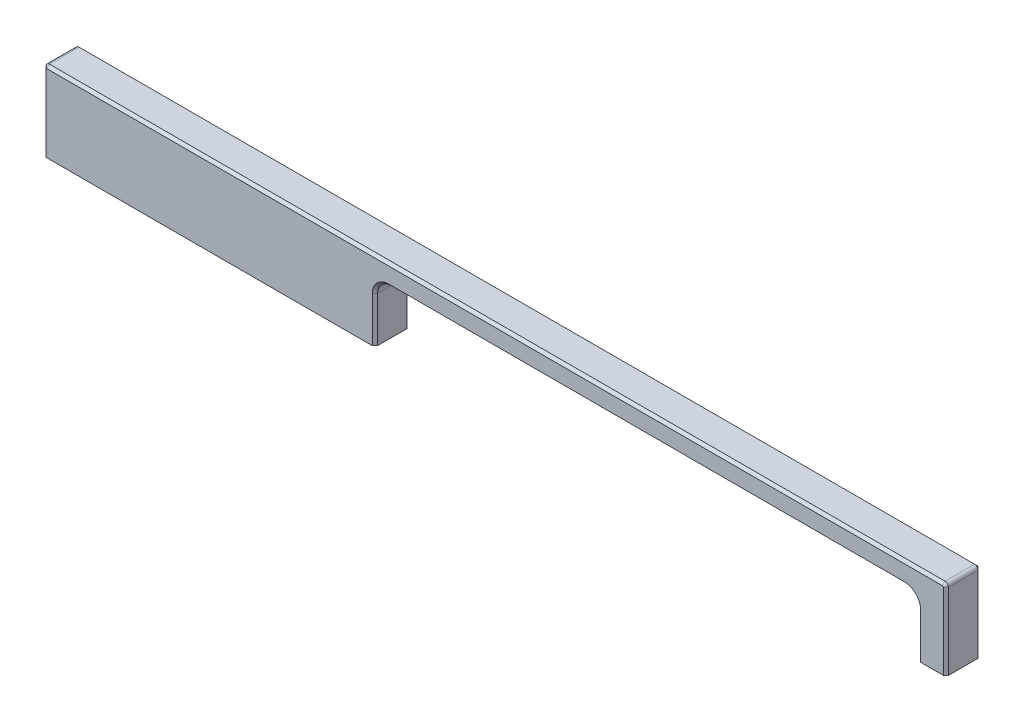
ISO-10303-21;
HEADER;
FILE_DESCRIPTION(('STEP AP214'),'2;1');
FILE_NAME('part.step','',(''),(''),'','','');
FILE_SCHEMA(('AUTOMOTIVE_DESIGN { 1 0 10303 214 1 1 1 1 }'));
ENDSEC;
DATA;
#1=APPLICATION_CONTEXT('core data for automotive mechanical design processes');
#2=APPLICATION_PROTOCOL_DEFINITION('international standard','automotive_design',2000,#1);
#3=PRODUCT_CONTEXT('',#1,'mechanical');
#4=PRODUCT('Part','Part','',(#3));
#5=PRODUCT_RELATED_PRODUCT_CATEGORY('part','',(#4));
#6=PRODUCT_DEFINITION_FORMATION('','',#4);
#7=PRODUCT_DEFINITION_CONTEXT('part definition',#1,'design');
#8=PRODUCT_DEFINITION('design','',#6,#7);
#9=PRODUCT_DEFINITION_SHAPE('','',#8);
#10=(LENGTH_UNIT() NAMED_UNIT(*) SI_UNIT(.MILLI.,.METRE.));
#11=(NAMED_UNIT(*) PLANE_ANGLE_UNIT() SI_UNIT($,.RADIAN.));
#12=(NAMED_UNIT(*) SI_UNIT($,.STERADIAN.) SOLID_ANGLE_UNIT());
#13=UNCERTAINTY_MEASURE_WITH_UNIT(LENGTH_MEASURE(1.E-05),#10,'distance_accuracy_value','');
#14=(GEOMETRIC_REPRESENTATION_CONTEXT(3) GLOBAL_UNCERTAINTY_ASSIGNED_CONTEXT((#13)) GLOBAL_UNIT_ASSIGNED_CONTEXT((#10,
#11,#12)) REPRESENTATION_CONTEXT('',''));
#15=CARTESIAN_POINT('',(0.,0.,0.));
#16=DIRECTION('',(0.,0.,1.));
#17=DIRECTION('',(1.,0.,0.));
#18=AXIS2_PLACEMENT_3D('',#15,#16,#17);
#19=CARTESIAN_POINT('',(130.,23.,5.));
#20=DIRECTION('',(-1.,0.,0.));
#21=DIRECTION('',(0.,0.,1.));
#22=AXIS2_PLACEMENT_3D('',#19,#20,#21);
#23=PLANE('',#22);
#24=DIRECTION('',(0.,0.,-1.));
#25=VECTOR('',#24,1.);
#26=CARTESIAN_POINT('',(130.,0.,5.));
#27=LINE('',#26,#25);
#28=CARTESIAN_POINT('',(130.,0.,4.25));
#29=VERTEX_POINT('',#28);
#30=CARTESIAN_POINT('',(130.,0.,-4.24999999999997));
#31=VERTEX_POINT('',#30);
#32=EDGE_CURVE('E248',#29,#31,#27,.T.);
#33=ORIENTED_EDGE('',*,*,#32,.T.);
#34=DIRECTION('',(0.,1.,0.));
#35=VECTOR('',#34,1.);
#36=CARTESIAN_POINT('',(130.,22.,-4.24999999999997));
#37=LINE('',#36,#35);
#38=CARTESIAN_POINT('',(130.,22.,-4.24999999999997));
#39=VERTEX_POINT('',#38);
#40=EDGE_CURVE('E390',#31,#39,#37,.T.);
#41=ORIENTED_EDGE('',*,*,#40,.T.);
#42=DIRECTION('',(0.,0.,-1.));
#43=VECTOR('',#42,1.);
#44=CARTESIAN_POINT('',(130.,22.,5.));
#45=LINE('',#44,#43);
#46=CARTESIAN_POINT('',(130.,22.,4.25));
#47=VERTEX_POINT('',#46);
#48=EDGE_CURVE('E294',#39,#47,#45,.F.);
#49=ORIENTED_EDGE('',*,*,#48,.T.);
#50=DIRECTION('',(0.,-1.,0.));
#51=VECTOR('',#50,1.);
#52=CARTESIAN_POINT('',(130.,23.,4.25));
#53=LINE('',#52,#51);
#54=EDGE_CURVE('E387',#47,#29,#53,.T.);
#55=ORIENTED_EDGE('',*,*,#54,.T.);
#56=EDGE_LOOP('',(#33,#41,#49,#55));
#57=FACE_BOUND('',#56,.T.);
#58=ADVANCED_FACE('F45',(#57),#23,.F.);
#59=CARTESIAN_POINT('',(-130.,23.,5.));
#60=DIRECTION('',(0.,-1.,0.));
#61=DIRECTION('',(0.,0.,-1.));
#62=AXIS2_PLACEMENT_3D('',#59,#60,#61);
#63=PLANE('',#62);
#64=DIRECTION('',(0.,0.,-1.));
#65=VECTOR('',#64,1.);
#66=CARTESIAN_POINT('',(129.,23.,5.));
#67=LINE('',#66,#65);
#68=CARTESIAN_POINT('',(129.,23.,4.25));
#69=VERTEX_POINT('',#68);
#70=CARTESIAN_POINT('',(129.,23.,-4.24999999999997));
#71=VERTEX_POINT('',#70);
#72=EDGE_CURVE('E290',#69,#71,#67,.T.);
#73=ORIENTED_EDGE('',*,*,#72,.T.);
#74=DIRECTION('',(-1.,0.,0.));
#75=VECTOR('',#74,1.);
#76=CARTESIAN_POINT('',(-129.,23.,-4.24999999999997));
#77=LINE('',#76,#75);
#78=CARTESIAN_POINT('',(-129.,23.,-4.24999999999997));
#79=VERTEX_POINT('',#78);
#80=EDGE_CURVE('E403',#71,#79,#77,.T.);
#81=ORIENTED_EDGE('',*,*,#80,.T.);
#82=DIRECTION('',(0.,0.,-1.));
#83=VECTOR('',#82,1.);
#84=CARTESIAN_POINT('',(-129.,23.,5.));
#85=LINE('',#84,#83);
#86=CARTESIAN_POINT('',(-129.,23.,4.25));
#87=VERTEX_POINT('',#86);
#88=EDGE_CURVE('E286',#79,#87,#85,.F.);
#89=ORIENTED_EDGE('',*,*,#88,.T.);
#90=DIRECTION('',(1.,0.,0.));
#91=VECTOR('',#90,1.);
#92=CARTESIAN_POINT('',(-130.,23.,4.25));
#93=LINE('',#92,#91);
#94=EDGE_CURVE('E400',#87,#69,#93,.T.);
#95=ORIENTED_EDGE('',*,*,#94,.T.);
#96=EDGE_LOOP('',(#73,#81,#89,#95));
#97=FACE_BOUND('',#96,.T.);
#98=ADVANCED_FACE('F576',(#97),#63,.F.);
#99=CARTESIAN_POINT('',(-130.,0.,5.));
#100=DIRECTION('',(1.,0.,0.));
#101=DIRECTION('',(0.,0.,-1.));
#102=AXIS2_PLACEMENT_3D('',#99,#100,#101);
#103=PLANE('',#102);
#104=DIRECTION('',(0.,0.,-1.));
#105=VECTOR('',#104,1.);
#106=CARTESIAN_POINT('',(-130.,22.,5.));
#107=LINE('',#106,#105);
#108=CARTESIAN_POINT('',(-130.,22.,4.25));
#109=VERTEX_POINT('',#108);
#110=CARTESIAN_POINT('',(-130.,22.,-4.24999999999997));
#111=VERTEX_POINT('',#110);
#112=EDGE_CURVE('E298',#109,#111,#107,.T.);
#113=ORIENTED_EDGE('',*,*,#112,.T.);
#114=DIRECTION('',(0.,-1.,0.));
#115=VECTOR('',#114,1.);
#116=CARTESIAN_POINT('',(-130.,0.,-4.24999999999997));
#117=LINE('',#116,#115);
#118=CARTESIAN_POINT('',(-130.,0.,-4.24999999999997));
#119=VERTEX_POINT('',#118);
#120=EDGE_CURVE('E415',#111,#119,#117,.T.);
#121=ORIENTED_EDGE('',*,*,#120,.T.);
#122=DIRECTION('',(0.,0.,-1.));
#123=VECTOR('',#122,1.);
#124=CARTESIAN_POINT('',(-130.,0.,5.));
#125=LINE('',#124,#123);
#126=CARTESIAN_POINT('',(-130.,0.,4.25));
#127=VERTEX_POINT('',#126);
#128=EDGE_CURVE('E266',#127,#119,#125,.T.);
#129=ORIENTED_EDGE('',*,*,#128,.F.);
#130=DIRECTION('',(0.,1.,0.));
#131=VECTOR('',#130,1.);
#132=CARTESIAN_POINT('',(-130.,0.,4.25));
#133=LINE('',#132,#131);
#134=EDGE_CURVE('E412',#127,#109,#133,.T.);
#135=ORIENTED_EDGE('',*,*,#134,.T.);
#136=EDGE_LOOP('',(#113,#121,#129,#135));
#137=FACE_BOUND('',#136,.T.);
#138=ADVANCED_FACE('F592',(#137),#103,.F.);
#139=CARTESIAN_POINT('',(-34.5,0.,5.));
#140=DIRECTION('',(0.,1.,0.));
#141=DIRECTION('',(-1.,0.,0.));
#142=AXIS2_PLACEMENT_3D('',#139,#140,#141);
#143=PLANE('',#142);
#144=CARTESIAN_POINT('',(-74.,0.,0.));
#145=DIRECTION('',(0.,-1.,0.));
#146=DIRECTION('',(0.,0.,-1.));
#147=AXIS2_PLACEMENT_3D('',#144,#145,#146);
#148=CIRCLE('',#147,1.64999999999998);
#149=CARTESIAN_POINT('',(-74.,0.,-1.64999999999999));
#150=VERTEX_POINT('',#149);
#151=EDGE_CURVE('E223',#150,#150,#148,.T.);
#152=ORIENTED_EDGE('',*,*,#151,.F.);
#153=EDGE_LOOP('',(#152));
#154=FACE_BOUND('',#153,.T.);
#155=DIRECTION('',(1.,0.,0.));
#156=VECTOR('',#155,1.);
#157=CARTESIAN_POINT('',(-34.5,0.,-5.));
#158=LINE('',#157,#156);
#159=CARTESIAN_POINT('',(-129.25,0.,-5.));
#160=VERTEX_POINT('',#159);
#161=CARTESIAN_POINT('',(-35.25,0.,-5.));
#162=VERTEX_POINT('',#161);
#163=EDGE_CURVE('E238',#160,#162,#158,.T.);
#164=ORIENTED_EDGE('',*,*,#163,.T.);
#165=DIRECTION('',(0.707106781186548,0.,0.707106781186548));
#166=VECTOR('',#165,1.);
#167=CARTESIAN_POINT('',(-34.5,0.,-4.24999999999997));
#168=LINE('',#167,#166);
#169=CARTESIAN_POINT('',(-34.5,0.,-4.24999999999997));
#170=VERTEX_POINT('',#169);
#171=EDGE_CURVE('E384',#162,#170,#168,.T.);
#172=ORIENTED_EDGE('',*,*,#171,.T.);
#173=DIRECTION('',(0.,0.,-1.));
#174=VECTOR('',#173,1.);
#175=CARTESIAN_POINT('',(-34.5,0.,5.));
#176=LINE('',#175,#174);
#177=CARTESIAN_POINT('',(-34.5,0.,4.24999999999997));
#178=VERTEX_POINT('',#177);
#179=EDGE_CURVE('E262',#178,#170,#176,.T.);
#180=ORIENTED_EDGE('',*,*,#179,.F.);
#181=DIRECTION('',(0.707106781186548,0.,-0.707106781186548));
#182=VECTOR('',#181,1.);
#183=CARTESIAN_POINT('',(-35.25,0.,5.));
#184=LINE('',#183,#182);
#185=CARTESIAN_POINT('',(-35.25,0.,5.));
#186=VERTEX_POINT('',#185);
#187=EDGE_CURVE('E378',#178,#186,#184,.F.);
#188=ORIENTED_EDGE('',*,*,#187,.T.);
#189=DIRECTION('',(1.,0.,0.));
#190=VECTOR('',#189,1.);
#191=CARTESIAN_POINT('',(-34.5,0.,5.));
#192=LINE('',#191,#190);
#193=CARTESIAN_POINT('',(-129.25,0.,5.));
#194=VERTEX_POINT('',#193);
#195=EDGE_CURVE('E239',#194,#186,#192,.T.);
#196=ORIENTED_EDGE('',*,*,#195,.F.);
#197=DIRECTION('',(0.707106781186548,0.,0.707106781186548));
#198=VECTOR('',#197,1.);
#199=CARTESIAN_POINT('',(-129.25,0.,5.));
#200=LINE('',#199,#198);
#201=EDGE_CURVE('E375',#194,#127,#200,.F.);
#202=ORIENTED_EDGE('',*,*,#201,.T.);
#203=ORIENTED_EDGE('',*,*,#128,.T.);
#204=DIRECTION('',(0.707106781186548,0.,-0.707106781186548));
#205=VECTOR('',#204,1.);
#206=CARTESIAN_POINT('',(-130.,0.,-4.24999999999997));
#207=LINE('',#206,#205);
#208=EDGE_CURVE('E381',#119,#160,#207,.T.);
#209=ORIENTED_EDGE('',*,*,#208,.T.);
#210=EDGE_LOOP('',(#164,#172,#180,#188,#196,#202,#203,#209));
#211=FACE_BOUND('',#210,.T.);
#212=ADVANCED_FACE('F518',(#154,#211),#143,.F.);
#213=CARTESIAN_POINT('',(-34.5,17.,5.));
#214=DIRECTION('',(-1.,0.,0.));
#215=DIRECTION('',(0.,0.,1.));
#216=AXIS2_PLACEMENT_3D('',#213,#214,#215);
#217=PLANE('',#216);
#218=ORIENTED_EDGE('',*,*,#179,.T.);
#219=DIRECTION('',(0.,1.,0.));
#220=VECTOR('',#219,1.);
#221=CARTESIAN_POINT('',(-34.5,13.,-4.24999999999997));
#222=LINE('',#221,#220);
#223=CARTESIAN_POINT('',(-34.5,13.,-4.24999999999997));
#224=VERTEX_POINT('',#223);
#225=EDGE_CURVE('E372',#170,#224,#222,.T.);
#226=ORIENTED_EDGE('',*,*,#225,.T.);
#227=DIRECTION('',(0.,0.,-1.));
#228=VECTOR('',#227,1.);
#229=CARTESIAN_POINT('',(-34.5,13.,5.));
#230=LINE('',#229,#228);
#231=CARTESIAN_POINT('',(-34.5,13.,4.24999999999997));
#232=VERTEX_POINT('',#231);
#233=EDGE_CURVE('E282',#224,#232,#230,.F.);
#234=ORIENTED_EDGE('',*,*,#233,.T.);
#235=DIRECTION('',(0.,-1.,0.));
#236=VECTOR('',#235,1.);
#237=CARTESIAN_POINT('',(-34.5,17.,4.24999999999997));
#238=LINE('',#237,#236);
#239=EDGE_CURVE('E369',#232,#178,#238,.T.);
#240=ORIENTED_EDGE('',*,*,#239,.T.);
#241=EDGE_LOOP('',(#218,#226,#234,#240));
#242=FACE_BOUND('',#241,.T.);
#243=ADVANCED_FACE('F646',(#242),#217,.F.);
#244=CARTESIAN_POINT('',(122.,17.,5.));
#245=DIRECTION('',(0.,1.,0.));
#246=DIRECTION('',(-1.,0.,0.));
#247=AXIS2_PLACEMENT_3D('',#244,#245,#246);
#248=PLANE('',#247);
#249=DIRECTION('',(0.,0.,-1.));
#250=VECTOR('',#249,1.);
#251=CARTESIAN_POINT('',(-30.5,17.,-5.));
#252=LINE('',#251,#250);
#253=CARTESIAN_POINT('',(-30.5,17.,4.24999999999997));
#254=VERTEX_POINT('',#253);
#255=CARTESIAN_POINT('',(-30.5,17.,-4.24999999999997));
#256=VERTEX_POINT('',#255);
#257=EDGE_CURVE('E274',#254,#256,#252,.T.);
#258=ORIENTED_EDGE('',*,*,#257,.T.);
#259=DIRECTION('',(1.,0.,0.));
#260=VECTOR('',#259,1.);
#261=CARTESIAN_POINT('',(118.,17.,-4.24999999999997));
#262=LINE('',#261,#260);
#263=CARTESIAN_POINT('',(118.,17.,-4.24999999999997));
#264=VERTEX_POINT('',#263);
#265=EDGE_CURVE('E360',#256,#264,#262,.T.);
#266=ORIENTED_EDGE('',*,*,#265,.T.);
#267=DIRECTION('',(0.,0.,-1.));
#268=VECTOR('',#267,1.);
#269=CARTESIAN_POINT('',(118.,17.,5.));
#270=LINE('',#269,#268);
#271=CARTESIAN_POINT('',(118.,17.,4.24999999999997));
#272=VERTEX_POINT('',#271);
#273=EDGE_CURVE('E278',#264,#272,#270,.F.);
#274=ORIENTED_EDGE('',*,*,#273,.T.);
#275=DIRECTION('',(-1.,0.,0.));
#276=VECTOR('',#275,1.);
#277=CARTESIAN_POINT('',(122.,17.,4.24999999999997));
#278=LINE('',#277,#276);
#279=EDGE_CURVE('E357',#272,#254,#278,.T.);
#280=ORIENTED_EDGE('',*,*,#279,.T.);
#281=EDGE_LOOP('',(#258,#266,#274,#280));
#282=FACE_BOUND('',#281,.T.);
#283=ADVANCED_FACE('F618',(#282),#248,.F.);
#284=CARTESIAN_POINT('',(122.,0.,5.));
#285=DIRECTION('',(1.,0.,0.));
#286=DIRECTION('',(0.,0.,-1.));
#287=AXIS2_PLACEMENT_3D('',#284,#285,#286);
#288=PLANE('',#287);
#289=DIRECTION('',(0.,0.,-1.));
#290=VECTOR('',#289,1.);
#291=CARTESIAN_POINT('',(122.,13.,-5.));
#292=LINE('',#291,#290);
#293=CARTESIAN_POINT('',(122.,13.,4.24999999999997));
#294=VERTEX_POINT('',#293);
#295=CARTESIAN_POINT('',(122.,13.,-4.24999999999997));
#296=VERTEX_POINT('',#295);
#297=EDGE_CURVE('E270',#294,#296,#292,.T.);
#298=ORIENTED_EDGE('',*,*,#297,.T.);
#299=DIRECTION('',(0.,-1.,0.));
#300=VECTOR('',#299,1.);
#301=CARTESIAN_POINT('',(122.,0.,-4.24999999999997));
#302=LINE('',#301,#300);
#303=CARTESIAN_POINT('',(122.,0.,-4.24999999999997));
#304=VERTEX_POINT('',#303);
#305=EDGE_CURVE('E305',#296,#304,#302,.T.);
#306=ORIENTED_EDGE('',*,*,#305,.T.);
#307=DIRECTION('',(0.,0.,-1.));
#308=VECTOR('',#307,1.);
#309=CARTESIAN_POINT('',(122.,0.,5.));
#310=LINE('',#309,#308);
#311=CARTESIAN_POINT('',(122.,0.,4.24999999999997));
#312=VERTEX_POINT('',#311);
#313=EDGE_CURVE('E258',#312,#304,#310,.T.);
#314=ORIENTED_EDGE('',*,*,#313,.F.);
#315=DIRECTION('',(0.,1.,0.));
#316=VECTOR('',#315,1.);
#317=CARTESIAN_POINT('',(122.,0.,4.24999999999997));
#318=LINE('',#317,#316);
#319=EDGE_CURVE('E302',#312,#294,#318,.T.);
#320=ORIENTED_EDGE('',*,*,#319,.T.);
#321=EDGE_LOOP('',(#298,#306,#314,#320));
#322=FACE_BOUND('',#321,.T.);
#323=ADVANCED_FACE('F637',(#322),#288,.F.);
#324=CARTESIAN_POINT('',(130.,0.,5.));
#325=DIRECTION('',(0.,1.,0.));
#326=DIRECTION('',(-1.,0.,0.));
#327=AXIS2_PLACEMENT_3D('',#324,#325,#326);
#328=PLANE('',#327);
#329=CARTESIAN_POINT('',(126.,0.,0.));
#330=DIRECTION('',(0.,-1.,0.));
#331=DIRECTION('',(0.,0.,-1.));
#332=AXIS2_PLACEMENT_3D('',#329,#330,#331);
#333=CIRCLE('',#332,1.64999999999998);
#334=CARTESIAN_POINT('',(126.,0.,-1.64999999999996));
#335=VERTEX_POINT('',#334);
#336=EDGE_CURVE('E224',#335,#335,#333,.T.);
#337=ORIENTED_EDGE('',*,*,#336,.F.);
#338=EDGE_LOOP('',(#337));
#339=FACE_BOUND('',#338,.T.);
#340=ORIENTED_EDGE('',*,*,#313,.T.);
#341=DIRECTION('',(0.707106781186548,0.,-0.707106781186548));
#342=VECTOR('',#341,1.);
#343=CARTESIAN_POINT('',(122.,0.,-4.24999999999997));
#344=LINE('',#343,#342);
#345=CARTESIAN_POINT('',(122.75,0.,-5.));
#346=VERTEX_POINT('',#345);
#347=EDGE_CURVE('E318',#304,#346,#344,.T.);
#348=ORIENTED_EDGE('',*,*,#347,.T.);
#349=DIRECTION('',(1.,0.,0.));
#350=VECTOR('',#349,1.);
#351=CARTESIAN_POINT('',(130.,0.,-5.));
#352=LINE('',#351,#350);
#353=CARTESIAN_POINT('',(129.25,0.,-5.));
#354=VERTEX_POINT('',#353);
#355=EDGE_CURVE('E244',#346,#354,#352,.T.);
#356=ORIENTED_EDGE('',*,*,#355,.T.);
#357=DIRECTION('',(0.707106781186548,0.,0.707106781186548));
#358=VECTOR('',#357,1.);
#359=CARTESIAN_POINT('',(130.,0.,-4.25));
#360=LINE('',#359,#358);
#361=EDGE_CURVE('E315',#354,#31,#360,.T.);
#362=ORIENTED_EDGE('',*,*,#361,.T.);
#363=ORIENTED_EDGE('',*,*,#32,.F.);
#364=DIRECTION('',(0.707106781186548,0.,-0.707106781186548));
#365=VECTOR('',#364,1.);
#366=CARTESIAN_POINT('',(129.25,0.,5.));
#367=LINE('',#366,#365);
#368=CARTESIAN_POINT('',(129.25,0.,5.));
#369=VERTEX_POINT('',#368);
#370=EDGE_CURVE('E309',#29,#369,#367,.F.);
#371=ORIENTED_EDGE('',*,*,#370,.T.);
#372=DIRECTION('',(1.,0.,0.));
#373=VECTOR('',#372,1.);
#374=CARTESIAN_POINT('',(130.,0.,5.));
#375=LINE('',#374,#373);
#376=CARTESIAN_POINT('',(122.75,0.,5.));
#377=VERTEX_POINT('',#376);
#378=EDGE_CURVE('E243',#377,#369,#375,.T.);
#379=ORIENTED_EDGE('',*,*,#378,.F.);
#380=DIRECTION('',(0.707106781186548,0.,0.707106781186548));
#381=VECTOR('',#380,1.);
#382=CARTESIAN_POINT('',(122.75,0.,5.));
#383=LINE('',#382,#381);
#384=EDGE_CURVE('E312',#377,#312,#383,.F.);
#385=ORIENTED_EDGE('',*,*,#384,.T.);
#386=EDGE_LOOP('',(#340,#348,#356,#362,#363,#371,#379,#385));
#387=FACE_BOUND('',#386,.T.);
#388=ADVANCED_FACE('F544',(#339,#387),#328,.F.);
#389=CARTESIAN_POINT('',(0.,0.,5.));
#390=DIRECTION('',(0.,0.,-1.));
#391=DIRECTION('',(-1.,0.,0.));
#392=AXIS2_PLACEMENT_3D('',#389,#390,#391);
#393=PLANE('',#392);
#394=CARTESIAN_POINT('',(118.,13.,5.));
#395=DIRECTION('',(0.,0.,-1.));
#396=DIRECTION('',(-1.,0.,0.));
#397=AXIS2_PLACEMENT_3D('',#394,#395,#396);
#398=CIRCLE('',#397,4.75000000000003);
#399=CARTESIAN_POINT('',(118.,17.75,5.));
#400=VERTEX_POINT('',#399);
#401=CARTESIAN_POINT('',(122.75,13.,5.));
#402=VERTEX_POINT('',#401);
#403=EDGE_CURVE('E56',#400,#402,#398,.T.);
#404=ORIENTED_EDGE('',*,*,#403,.T.);
#405=DIRECTION('',(0.,-1.,0.));
#406=VECTOR('',#405,1.);
#407=CARTESIAN_POINT('',(122.75,0.,5.));
#408=LINE('',#407,#406);
#409=EDGE_CURVE('E11',#402,#377,#408,.T.);
#410=ORIENTED_EDGE('',*,*,#409,.T.);
#411=ORIENTED_EDGE('',*,*,#378,.T.);
#412=DIRECTION('',(0.,1.,0.));
#413=VECTOR('',#412,1.);
#414=CARTESIAN_POINT('',(129.25,0.,5.));
#415=LINE('',#414,#413);
#416=CARTESIAN_POINT('',(129.25,22.,5.));
#417=VERTEX_POINT('',#416);
#418=EDGE_CURVE('E430',#369,#417,#415,.T.);
#419=ORIENTED_EDGE('',*,*,#418,.T.);
#420=CARTESIAN_POINT('',(129.,22.,5.));
#421=DIRECTION('',(0.,0.,-1.));
#422=DIRECTION('',(-1.,0.,0.));
#423=AXIS2_PLACEMENT_3D('',#420,#421,#422);
#424=CIRCLE('',#423,0.25);
#425=CARTESIAN_POINT('',(129.,22.25,5.));
#426=VERTEX_POINT('',#425);
#427=EDGE_CURVE('E427',#417,#426,#424,.F.);
#428=ORIENTED_EDGE('',*,*,#427,.T.);
#429=DIRECTION('',(-1.,0.,0.));
#430=VECTOR('',#429,1.);
#431=CARTESIAN_POINT('',(0.,22.25,5.));
#432=LINE('',#431,#430);
#433=CARTESIAN_POINT('',(-129.,22.25,5.));
#434=VERTEX_POINT('',#433);
#435=EDGE_CURVE('E424',#426,#434,#432,.T.);
#436=ORIENTED_EDGE('',*,*,#435,.T.);
#437=CARTESIAN_POINT('',(-129.,22.,5.));
#438=DIRECTION('',(0.,0.,-1.));
#439=DIRECTION('',(-1.,0.,0.));
#440=AXIS2_PLACEMENT_3D('',#437,#438,#439);
#441=CIRCLE('',#440,0.25);
#442=CARTESIAN_POINT('',(-129.25,22.,5.));
#443=VERTEX_POINT('',#442);
#444=EDGE_CURVE('E421',#434,#443,#441,.F.);
#445=ORIENTED_EDGE('',*,*,#444,.T.);
#446=DIRECTION('',(0.,-1.,0.));
#447=VECTOR('',#446,1.);
#448=CARTESIAN_POINT('',(-129.25,0.,5.));
#449=LINE('',#448,#447);
#450=EDGE_CURVE('E418',#443,#194,#449,.T.);
#451=ORIENTED_EDGE('',*,*,#450,.T.);
#452=ORIENTED_EDGE('',*,*,#195,.T.);
#453=DIRECTION('',(0.,1.,0.));
#454=VECTOR('',#453,1.);
#455=CARTESIAN_POINT('',(-35.25,0.,5.));
#456=LINE('',#455,#454);
#457=CARTESIAN_POINT('',(-35.25,13.,5.));
#458=VERTEX_POINT('',#457);
#459=EDGE_CURVE('E434',#186,#458,#456,.T.);
#460=ORIENTED_EDGE('',*,*,#459,.T.);
#461=CARTESIAN_POINT('',(-30.5,13.,5.));
#462=DIRECTION('',(0.,0.,-1.));
#463=DIRECTION('',(-1.,0.,0.));
#464=AXIS2_PLACEMENT_3D('',#461,#462,#463);
#465=CIRCLE('',#464,4.75000000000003);
#466=CARTESIAN_POINT('',(-30.5,17.75,5.));
#467=VERTEX_POINT('',#466);
#468=EDGE_CURVE('E437',#458,#467,#465,.T.);
#469=ORIENTED_EDGE('',*,*,#468,.T.);
#470=DIRECTION('',(1.,0.,0.));
#471=VECTOR('',#470,1.);
#472=CARTESIAN_POINT('',(0.,17.75,5.));
#473=LINE('',#472,#471);
#474=EDGE_CURVE('E67',#467,#400,#473,.T.);
#475=ORIENTED_EDGE('',*,*,#474,.T.);
#476=EDGE_LOOP('',(#404,#410,#411,#419,#428,#436,#445,#451,#452,#460,#469,#475));
#477=FACE_BOUND('',#476,.T.);
#478=ADVANCED_FACE('F515',(#477),#393,.F.);
#479=CARTESIAN_POINT('',(0.,0.,-5.));
#480=DIRECTION('',(0.,0.,-1.));
#481=DIRECTION('',(-1.,0.,0.));
#482=AXIS2_PLACEMENT_3D('',#479,#480,#481);
#483=PLANE('',#482);
#484=ORIENTED_EDGE('',*,*,#355,.F.);
#485=DIRECTION('',(0.,1.,0.));
#486=VECTOR('',#485,1.);
#487=CARTESIAN_POINT('',(122.75,13.,-5.));
#488=LINE('',#487,#486);
#489=CARTESIAN_POINT('',(122.75,13.,-5.));
#490=VERTEX_POINT('',#489);
#491=EDGE_CURVE('E348',#346,#490,#488,.T.);
#492=ORIENTED_EDGE('',*,*,#491,.T.);
#493=CARTESIAN_POINT('',(118.,13.,-5.));
#494=DIRECTION('',(0.,0.,-1.));
#495=DIRECTION('',(-1.,0.,0.));
#496=AXIS2_PLACEMENT_3D('',#493,#494,#495);
#497=CIRCLE('',#496,4.75000000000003);
#498=CARTESIAN_POINT('',(118.,17.75,-5.));
#499=VERTEX_POINT('',#498);
#500=EDGE_CURVE('E345',#490,#499,#497,.F.);
#501=ORIENTED_EDGE('',*,*,#500,.T.);
#502=DIRECTION('',(-1.,0.,0.));
#503=VECTOR('',#502,1.);
#504=CARTESIAN_POINT('',(-30.5,17.75,-5.));
#505=LINE('',#504,#503);
#506=CARTESIAN_POINT('',(-30.5,17.75,-5.));
#507=VERTEX_POINT('',#506);
#508=EDGE_CURVE('E342',#499,#507,#505,.T.);
#509=ORIENTED_EDGE('',*,*,#508,.T.);
#510=CARTESIAN_POINT('',(-30.5,13.,-5.));
#511=DIRECTION('',(0.,0.,-1.));
#512=DIRECTION('',(-1.,0.,0.));
#513=AXIS2_PLACEMENT_3D('',#510,#511,#512);
#514=CIRCLE('',#513,4.75000000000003);
#515=CARTESIAN_POINT('',(-35.25,13.,-5.));
#516=VERTEX_POINT('',#515);
#517=EDGE_CURVE('E339',#507,#516,#514,.F.);
#518=ORIENTED_EDGE('',*,*,#517,.T.);
#519=DIRECTION('',(0.,-1.,0.));
#520=VECTOR('',#519,1.);
#521=CARTESIAN_POINT('',(-35.25,0.,-5.));
#522=LINE('',#521,#520);
#523=EDGE_CURVE('E336',#516,#162,#522,.T.);
#524=ORIENTED_EDGE('',*,*,#523,.T.);
#525=ORIENTED_EDGE('',*,*,#163,.F.);
#526=DIRECTION('',(0.,1.,0.));
#527=VECTOR('',#526,1.);
#528=CARTESIAN_POINT('',(-129.25,22.,-5.));
#529=LINE('',#528,#527);
#530=CARTESIAN_POINT('',(-129.25,22.,-5.));
#531=VERTEX_POINT('',#530);
#532=EDGE_CURVE('E321',#160,#531,#529,.T.);
#533=ORIENTED_EDGE('',*,*,#532,.T.);
#534=CARTESIAN_POINT('',(-129.,22.,-5.));
#535=DIRECTION('',(0.,0.,-1.));
#536=DIRECTION('',(-1.,0.,0.));
#537=AXIS2_PLACEMENT_3D('',#534,#535,#536);
#538=CIRCLE('',#537,0.249999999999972);
#539=CARTESIAN_POINT('',(-129.,22.25,-5.));
#540=VERTEX_POINT('',#539);
#541=EDGE_CURVE('E324',#531,#540,#538,.T.);
#542=ORIENTED_EDGE('',*,*,#541,.T.);
#543=DIRECTION('',(1.,0.,0.));
#544=VECTOR('',#543,1.);
#545=CARTESIAN_POINT('',(129.,22.25,-5.));
#546=LINE('',#545,#544);
#547=CARTESIAN_POINT('',(129.,22.25,-5.));
#548=VERTEX_POINT('',#547);
#549=EDGE_CURVE('E327',#540,#548,#546,.T.);
#550=ORIENTED_EDGE('',*,*,#549,.T.);
#551=CARTESIAN_POINT('',(129.,22.,-5.));
#552=DIRECTION('',(0.,0.,-1.));
#553=DIRECTION('',(-1.,0.,0.));
#554=AXIS2_PLACEMENT_3D('',#551,#552,#553);
#555=CIRCLE('',#554,0.249999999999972);
#556=CARTESIAN_POINT('',(129.25,22.,-5.));
#557=VERTEX_POINT('',#556);
#558=EDGE_CURVE('E330',#548,#557,#555,.T.);
#559=ORIENTED_EDGE('',*,*,#558,.T.);
#560=DIRECTION('',(0.,-1.,0.));
#561=VECTOR('',#560,1.);
#562=CARTESIAN_POINT('',(129.25,0.,-5.));
#563=LINE('',#562,#561);
#564=EDGE_CURVE('E333',#557,#354,#563,.T.);
#565=ORIENTED_EDGE('',*,*,#564,.T.);
#566=EDGE_LOOP('',(#484,#492,#501,#509,#518,#524,#525,#533,#542,#550,#559,#565));
#567=FACE_BOUND('',#566,.T.);
#568=ADVANCED_FACE('F601',(#567),#483,.T.);
#569=CARTESIAN_POINT('',(-74.,11.5,0.));
#570=DIRECTION('',(0.,-1.,0.));
#571=DIRECTION('',(0.,0.,-1.));
#572=AXIS2_PLACEMENT_3D('',#569,#570,#571);
#573=CONICAL_SURFACE('',#572,1.65,1.02974425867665);
#574=CARTESIAN_POINT('',(-74.,12.4914200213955,0.));
#575=VERTEX_POINT('',#574);
#576=VERTEX_LOOP('',#575);
#577=FACE_BOUND('',#576,.T.);
#578=CARTESIAN_POINT('',(-74.,11.5,0.));
#579=DIRECTION('',(0.,-1.,0.));
#580=DIRECTION('',(0.,0.,-1.));
#581=AXIS2_PLACEMENT_3D('',#578,#579,#580);
#582=CIRCLE('',#581,1.65);
#583=CARTESIAN_POINT('',(-74.,11.5,-1.65000000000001));
#584=VERTEX_POINT('',#583);
#585=EDGE_CURVE('E229',#584,#584,#582,.T.);
#586=ORIENTED_EDGE('',*,*,#585,.T.);
#587=EDGE_LOOP('',(#586));
#588=FACE_BOUND('',#587,.T.);
#589=ADVANCED_FACE('F857',(#577,#588),#573,.F.);
#590=CARTESIAN_POINT('',(-74.,0.,0.));
#591=DIRECTION('',(0.,-1.,0.));
#592=DIRECTION('',(0.,0.,-1.));
#593=AXIS2_PLACEMENT_3D('',#590,#591,#592);
#594=CYLINDRICAL_SURFACE('',#593,1.64999999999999);
#595=ORIENTED_EDGE('',*,*,#585,.F.);
#596=EDGE_LOOP('',(#595));
#597=FACE_BOUND('',#596,.T.);
#598=ORIENTED_EDGE('',*,*,#151,.T.);
#599=EDGE_LOOP('',(#598));
#600=FACE_BOUND('',#599,.T.);
#601=ADVANCED_FACE('F216',(#597,#600),#594,.F.);
#602=CARTESIAN_POINT('',(126.,11.5,0.));
#603=DIRECTION('',(0.,-1.,0.));
#604=DIRECTION('',(0.,0.,-1.));
#605=AXIS2_PLACEMENT_3D('',#602,#603,#604);
#606=CONICAL_SURFACE('',#605,1.64999999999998,1.02974425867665);
#607=CARTESIAN_POINT('',(126.,12.4914200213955,0.));
#608=VERTEX_POINT('',#607);
#609=VERTEX_LOOP('',#608);
#610=FACE_BOUND('',#609,.T.);
#611=CARTESIAN_POINT('',(126.,11.5,0.));
#612=DIRECTION('',(0.,-1.,0.));
#613=DIRECTION('',(0.,0.,-1.));
#614=AXIS2_PLACEMENT_3D('',#611,#612,#613);
#615=CIRCLE('',#614,1.64999999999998);
#616=CARTESIAN_POINT('',(126.,11.5,-1.64999999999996));
#617=VERTEX_POINT('',#616);
#618=EDGE_CURVE('E220',#617,#617,#615,.T.);
#619=ORIENTED_EDGE('',*,*,#618,.T.);
#620=EDGE_LOOP('',(#619));
#621=FACE_BOUND('',#620,.T.);
#622=ADVANCED_FACE('F212',(#610,#621),#606,.F.);
#623=CARTESIAN_POINT('',(126.,0.,0.));
#624=DIRECTION('',(0.,-1.,0.));
#625=DIRECTION('',(0.,0.,-1.));
#626=AXIS2_PLACEMENT_3D('',#623,#624,#625);
#627=CYLINDRICAL_SURFACE('',#626,1.64999999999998);
#628=ORIENTED_EDGE('',*,*,#618,.F.);
#629=EDGE_LOOP('',(#628));
#630=FACE_BOUND('',#629,.T.);
#631=ORIENTED_EDGE('',*,*,#336,.T.);
#632=EDGE_LOOP('',(#631));
#633=FACE_BOUND('',#632,.T.);
#634=ADVANCED_FACE('F215',(#630,#633),#627,.F.);
#635=CARTESIAN_POINT('',(118.,13.,5.));
#636=DIRECTION('',(0.,0.,1.));
#637=DIRECTION('',(1.,0.,0.));
#638=AXIS2_PLACEMENT_3D('',#635,#636,#637);
#639=CYLINDRICAL_SURFACE('',#638,4.);
#640=ORIENTED_EDGE('',*,*,#273,.F.);
#641=CARTESIAN_POINT('',(118.,13.,-4.24999999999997));
#642=DIRECTION('',(0.,0.,-1.));
#643=DIRECTION('',(-1.,0.,0.));
#644=AXIS2_PLACEMENT_3D('',#641,#642,#643);
#645=CIRCLE('',#644,4.);
#646=EDGE_CURVE('E354',#264,#296,#645,.T.);
#647=ORIENTED_EDGE('',*,*,#646,.T.);
#648=ORIENTED_EDGE('',*,*,#297,.F.);
#649=CARTESIAN_POINT('',(118.,13.,4.24999999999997));
#650=DIRECTION('',(0.,0.,-1.));
#651=DIRECTION('',(-1.,0.,0.));
#652=AXIS2_PLACEMENT_3D('',#649,#650,#651);
#653=CIRCLE('',#652,4.);
#654=EDGE_CURVE('E351',#294,#272,#653,.F.);
#655=ORIENTED_EDGE('',*,*,#654,.T.);
#656=EDGE_LOOP('',(#640,#647,#648,#655));
#657=FACE_BOUND('',#656,.T.);
#658=ADVANCED_FACE('F622',(#657),#639,.F.);
#659=CARTESIAN_POINT('',(-30.5,13.,5.));
#660=DIRECTION('',(0.,0.,1.));
#661=DIRECTION('',(1.,0.,0.));
#662=AXIS2_PLACEMENT_3D('',#659,#660,#661);
#663=CYLINDRICAL_SURFACE('',#662,4.);
#664=ORIENTED_EDGE('',*,*,#233,.F.);
#665=CARTESIAN_POINT('',(-30.5,13.,-4.24999999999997));
#666=DIRECTION('',(0.,0.,-1.));
#667=DIRECTION('',(-1.,0.,0.));
#668=AXIS2_PLACEMENT_3D('',#665,#666,#667);
#669=CIRCLE('',#668,4.);
#670=EDGE_CURVE('E366',#224,#256,#669,.T.);
#671=ORIENTED_EDGE('',*,*,#670,.T.);
#672=ORIENTED_EDGE('',*,*,#257,.F.);
#673=CARTESIAN_POINT('',(-30.5,13.,4.24999999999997));
#674=DIRECTION('',(0.,0.,-1.));
#675=DIRECTION('',(-1.,0.,0.));
#676=AXIS2_PLACEMENT_3D('',#673,#674,#675);
#677=CIRCLE('',#676,4.);
#678=EDGE_CURVE('E363',#254,#232,#677,.F.);
#679=ORIENTED_EDGE('',*,*,#678,.T.);
#680=EDGE_LOOP('',(#664,#671,#672,#679));
#681=FACE_BOUND('',#680,.T.);
#682=ADVANCED_FACE('F616',(#681),#663,.F.);
#683=CARTESIAN_POINT('',(129.,22.,5.));
#684=DIRECTION('',(0.,0.,-1.));
#685=DIRECTION('',(-1.,0.,0.));
#686=AXIS2_PLACEMENT_3D('',#683,#684,#685);
#687=CYLINDRICAL_SURFACE('',#686,1.);
#688=ORIENTED_EDGE('',*,*,#48,.F.);
#689=CARTESIAN_POINT('',(129.,22.,-4.24999999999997));
#690=DIRECTION('',(0.,0.,-1.));
#691=DIRECTION('',(-1.,0.,0.));
#692=AXIS2_PLACEMENT_3D('',#689,#690,#691);
#693=CIRCLE('',#692,1.);
#694=EDGE_CURVE('E397',#39,#71,#693,.F.);
#695=ORIENTED_EDGE('',*,*,#694,.T.);
#696=ORIENTED_EDGE('',*,*,#72,.F.);
#697=CARTESIAN_POINT('',(129.,22.,4.25));
#698=DIRECTION('',(0.,0.,-1.));
#699=DIRECTION('',(-1.,0.,0.));
#700=AXIS2_PLACEMENT_3D('',#697,#698,#699);
#701=CIRCLE('',#700,1.);
#702=EDGE_CURVE('E394',#69,#47,#701,.T.);
#703=ORIENTED_EDGE('',*,*,#702,.T.);
#704=EDGE_LOOP('',(#688,#695,#696,#703));
#705=FACE_BOUND('',#704,.T.);
#706=ADVANCED_FACE('F561',(#705),#687,.T.);
#707=CARTESIAN_POINT('',(-129.,22.,5.));
#708=DIRECTION('',(0.,0.,-1.));
#709=DIRECTION('',(-1.,0.,0.));
#710=AXIS2_PLACEMENT_3D('',#707,#708,#709);
#711=CYLINDRICAL_SURFACE('',#710,1.);
#712=ORIENTED_EDGE('',*,*,#88,.F.);
#713=CARTESIAN_POINT('',(-129.,22.,-4.24999999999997));
#714=DIRECTION('',(0.,0.,-1.));
#715=DIRECTION('',(-1.,0.,0.));
#716=AXIS2_PLACEMENT_3D('',#713,#714,#715);
#717=CIRCLE('',#716,1.);
#718=EDGE_CURVE('E409',#79,#111,#717,.F.);
#719=ORIENTED_EDGE('',*,*,#718,.T.);
#720=ORIENTED_EDGE('',*,*,#112,.F.);
#721=CARTESIAN_POINT('',(-129.,22.,4.25));
#722=DIRECTION('',(0.,0.,-1.));
#723=DIRECTION('',(-1.,0.,0.));
#724=AXIS2_PLACEMENT_3D('',#721,#722,#723);
#725=CIRCLE('',#724,1.);
#726=EDGE_CURVE('E406',#109,#87,#725,.T.);
#727=ORIENTED_EDGE('',*,*,#726,.T.);
#728=EDGE_LOOP('',(#712,#719,#720,#727));
#729=FACE_BOUND('',#728,.T.);
#730=ADVANCED_FACE('F589',(#729),#711,.T.);
#731=CARTESIAN_POINT('',(-34.5,17.,-4.24999999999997));
#732=DIRECTION('',(0.707106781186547,0.,-0.707106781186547));
#733=DIRECTION('',(0.,-1.,0.));
#734=AXIS2_PLACEMENT_3D('',#731,#732,#733);
#735=PLANE('',#734);
#736=ORIENTED_EDGE('',*,*,#171,.F.);
#737=ORIENTED_EDGE('',*,*,#523,.F.);
#738=DIRECTION('',(-0.707106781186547,0.,-0.707106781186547));
#739=VECTOR('',#738,1.);
#740=CARTESIAN_POINT('',(-34.5,13.,-4.24999999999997));
#741=LINE('',#740,#739);
#742=EDGE_CURVE('E232',#224,#516,#741,.T.);
#743=ORIENTED_EDGE('',*,*,#742,.F.);
#744=ORIENTED_EDGE('',*,*,#225,.F.);
#745=EDGE_LOOP('',(#736,#737,#743,#744));
#746=FACE_BOUND('',#745,.T.);
#747=ADVANCED_FACE('F606',(#746),#735,.T.);
#748=CARTESIAN_POINT('',(-30.5,13.,-5.));
#749=DIRECTION('',(0.,0.,-1.));
#750=DIRECTION('',(-1.,0.,0.));
#751=AXIS2_PLACEMENT_3D('',#748,#749,#750);
#752=CONICAL_SURFACE('',#751,4.75000000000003,0.785398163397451);
#753=ORIENTED_EDGE('',*,*,#742,.T.);
#754=ORIENTED_EDGE('',*,*,#517,.F.);
#755=DIRECTION('',(0.,0.707106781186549,-0.707106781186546));
#756=VECTOR('',#755,1.);
#757=CARTESIAN_POINT('',(-30.5,17.,-4.24999999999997));
#758=LINE('',#757,#756);
#759=EDGE_CURVE('E453',#256,#507,#758,.T.);
#760=ORIENTED_EDGE('',*,*,#759,.F.);
#761=ORIENTED_EDGE('',*,*,#670,.F.);
#762=EDGE_LOOP('',(#753,#754,#760,#761));
#763=FACE_BOUND('',#762,.T.);
#764=ADVANCED_FACE('F610',(#763),#752,.F.);
#765=CARTESIAN_POINT('',(122.,17.,-4.24999999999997));
#766=DIRECTION('',(0.,-0.707106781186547,-0.707106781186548));
#767=DIRECTION('',(-1.,0.,0.));
#768=AXIS2_PLACEMENT_3D('',#765,#766,#767);
#769=PLANE('',#768);
#770=ORIENTED_EDGE('',*,*,#759,.T.);
#771=ORIENTED_EDGE('',*,*,#508,.F.);
#772=DIRECTION('',(0.,0.707106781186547,-0.707106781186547));
#773=VECTOR('',#772,1.);
#774=CARTESIAN_POINT('',(118.,17.,-4.24999999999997));
#775=LINE('',#774,#773);
#776=EDGE_CURVE('E448',#264,#499,#775,.T.);
#777=ORIENTED_EDGE('',*,*,#776,.F.);
#778=ORIENTED_EDGE('',*,*,#265,.F.);
#779=EDGE_LOOP('',(#770,#771,#777,#778));
#780=FACE_BOUND('',#779,.T.);
#781=ADVANCED_FACE('F627',(#780),#769,.T.);
#782=CARTESIAN_POINT('',(118.,13.,-5.));
#783=DIRECTION('',(0.,0.,-1.));
#784=DIRECTION('',(-1.,0.,0.));
#785=AXIS2_PLACEMENT_3D('',#782,#783,#784);
#786=CONICAL_SURFACE('',#785,4.75000000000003,0.785398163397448);
#787=ORIENTED_EDGE('',*,*,#776,.T.);
#788=ORIENTED_EDGE('',*,*,#500,.F.);
#789=DIRECTION('',(0.707106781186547,0.,-0.707106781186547));
#790=VECTOR('',#789,1.);
#791=CARTESIAN_POINT('',(122.,13.,-4.24999999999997));
#792=LINE('',#791,#790);
#793=EDGE_CURVE('E444',#296,#490,#792,.T.);
#794=ORIENTED_EDGE('',*,*,#793,.F.);
#795=ORIENTED_EDGE('',*,*,#646,.F.);
#796=EDGE_LOOP('',(#787,#788,#794,#795));
#797=FACE_BOUND('',#796,.T.);
#798=ADVANCED_FACE('F631',(#797),#786,.F.);
#799=CARTESIAN_POINT('',(122.,0.,-4.24999999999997));
#800=DIRECTION('',(-0.707106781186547,0.,-0.707106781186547));
#801=DIRECTION('',(0.,1.,0.));
#802=AXIS2_PLACEMENT_3D('',#799,#800,#801);
#803=PLANE('',#802);
#804=ORIENTED_EDGE('',*,*,#793,.T.);
#805=ORIENTED_EDGE('',*,*,#491,.F.);
#806=ORIENTED_EDGE('',*,*,#347,.F.);
#807=ORIENTED_EDGE('',*,*,#305,.F.);
#808=EDGE_LOOP('',(#804,#805,#806,#807));
#809=FACE_BOUND('',#808,.T.);
#810=ADVANCED_FACE('F635',(#809),#803,.T.);
#811=CARTESIAN_POINT('',(-130.,0.,-4.24999999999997));
#812=DIRECTION('',(-0.707106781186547,0.,-0.707106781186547));
#813=DIRECTION('',(0.,1.,0.));
#814=AXIS2_PLACEMENT_3D('',#811,#812,#813);
#815=PLANE('',#814);
#816=ORIENTED_EDGE('',*,*,#208,.F.);
#817=ORIENTED_EDGE('',*,*,#120,.F.);
#818=DIRECTION('',(-0.707106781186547,0.,0.707106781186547));
#819=VECTOR('',#818,1.);
#820=CARTESIAN_POINT('',(-129.25,22.,-5.));
#821=LINE('',#820,#819);
#822=EDGE_CURVE('E449',#531,#111,#821,.T.);
#823=ORIENTED_EDGE('',*,*,#822,.F.);
#824=ORIENTED_EDGE('',*,*,#532,.F.);
#825=EDGE_LOOP('',(#816,#817,#823,#824));
#826=FACE_BOUND('',#825,.T.);
#827=ADVANCED_FACE('F595',(#826),#815,.T.);
#828=CARTESIAN_POINT('',(-129.,22.,-5.));
#829=DIRECTION('',(0.,0.,1.));
#830=DIRECTION('',(1.,0.,0.));
#831=AXIS2_PLACEMENT_3D('',#828,#829,#830);
#832=CONICAL_SURFACE('',#831,0.249999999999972,0.785398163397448);
#833=ORIENTED_EDGE('',*,*,#822,.T.);
#834=ORIENTED_EDGE('',*,*,#718,.F.);
#835=DIRECTION('',(0.,0.707106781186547,0.707106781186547));
#836=VECTOR('',#835,1.);
#837=CARTESIAN_POINT('',(-129.,22.25,-5.));
#838=LINE('',#837,#836);
#839=EDGE_CURVE('E468',#540,#79,#838,.T.);
#840=ORIENTED_EDGE('',*,*,#839,.F.);
#841=ORIENTED_EDGE('',*,*,#541,.F.);
#842=EDGE_LOOP('',(#833,#834,#840,#841));
#843=FACE_BOUND('',#842,.T.);
#844=ADVANCED_FACE('F585',(#843),#832,.T.);
#845=CARTESIAN_POINT('',(-130.,23.,-4.24999999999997));
#846=DIRECTION('',(0.,0.707106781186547,-0.707106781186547));
#847=DIRECTION('',(1.,0.,0.));
#848=AXIS2_PLACEMENT_3D('',#845,#846,#847);
#849=PLANE('',#848);
#850=ORIENTED_EDGE('',*,*,#839,.T.);
#851=ORIENTED_EDGE('',*,*,#80,.F.);
#852=DIRECTION('',(0.,0.707106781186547,0.707106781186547));
#853=VECTOR('',#852,1.);
#854=CARTESIAN_POINT('',(129.,22.25,-5.));
#855=LINE('',#854,#853);
#856=EDGE_CURVE('E463',#548,#71,#855,.T.);
#857=ORIENTED_EDGE('',*,*,#856,.F.);
#858=ORIENTED_EDGE('',*,*,#549,.F.);
#859=EDGE_LOOP('',(#850,#851,#857,#858));
#860=FACE_BOUND('',#859,.T.);
#861=ADVANCED_FACE('F579',(#860),#849,.T.);
#862=CARTESIAN_POINT('',(129.,22.,-5.));
#863=DIRECTION('',(0.,0.,1.));
#864=DIRECTION('',(1.,0.,0.));
#865=AXIS2_PLACEMENT_3D('',#862,#863,#864);
#866=CONICAL_SURFACE('',#865,0.249999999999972,0.785398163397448);
#867=ORIENTED_EDGE('',*,*,#856,.T.);
#868=ORIENTED_EDGE('',*,*,#694,.F.);
#869=DIRECTION('',(0.707106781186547,0.,0.707106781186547));
#870=VECTOR('',#869,1.);
#871=CARTESIAN_POINT('',(129.25,22.,-5.));
#872=LINE('',#871,#870);
#873=EDGE_CURVE('E460',#557,#39,#872,.T.);
#874=ORIENTED_EDGE('',*,*,#873,.F.);
#875=ORIENTED_EDGE('',*,*,#558,.F.);
#876=EDGE_LOOP('',(#867,#868,#874,#875));
#877=FACE_BOUND('',#876,.T.);
#878=ADVANCED_FACE('F572',(#877),#866,.T.);
#879=CARTESIAN_POINT('',(130.,23.,-4.24999999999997));
#880=DIRECTION('',(0.707106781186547,0.,-0.707106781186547));
#881=DIRECTION('',(0.,-1.,0.));
#882=AXIS2_PLACEMENT_3D('',#879,#880,#881);
#883=PLANE('',#882);
#884=ORIENTED_EDGE('',*,*,#361,.F.);
#885=ORIENTED_EDGE('',*,*,#564,.F.);
#886=ORIENTED_EDGE('',*,*,#873,.T.);
#887=ORIENTED_EDGE('',*,*,#40,.F.);
#888=EDGE_LOOP('',(#884,#885,#886,#887));
#889=FACE_BOUND('',#888,.T.);
#890=ADVANCED_FACE('F566',(#889),#883,.T.);
#891=CARTESIAN_POINT('',(-35.25,0.,5.));
#892=DIRECTION('',(-0.707106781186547,0.,-0.707106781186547));
#893=DIRECTION('',(0.,1.,0.));
#894=AXIS2_PLACEMENT_3D('',#891,#892,#893);
#895=PLANE('',#894);
#896=ORIENTED_EDGE('',*,*,#187,.F.);
#897=ORIENTED_EDGE('',*,*,#239,.F.);
#898=DIRECTION('',(0.707106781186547,0.,-0.707106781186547));
#899=VECTOR('',#898,1.);
#900=CARTESIAN_POINT('',(-35.25,13.,5.));
#901=LINE('',#900,#899);
#902=EDGE_CURVE('E464',#458,#232,#901,.T.);
#903=ORIENTED_EDGE('',*,*,#902,.F.);
#904=ORIENTED_EDGE('',*,*,#459,.F.);
#905=EDGE_LOOP('',(#896,#897,#903,#904));
#906=FACE_BOUND('',#905,.T.);
#907=ADVANCED_FACE('F524',(#906),#895,.F.);
#908=CARTESIAN_POINT('',(-30.5,13.,5.));
#909=DIRECTION('',(0.,0.,1.));
#910=DIRECTION('',(1.,0.,0.));
#911=AXIS2_PLACEMENT_3D('',#908,#909,#910);
#912=CONICAL_SURFACE('',#911,4.75000000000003,0.785398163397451);
#913=ORIENTED_EDGE('',*,*,#902,.T.);
#914=ORIENTED_EDGE('',*,*,#678,.F.);
#915=DIRECTION('',(0.,-0.707106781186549,-0.707106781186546));
#916=VECTOR('',#915,1.);
#917=CARTESIAN_POINT('',(-30.5,17.75,5.));
#918=LINE('',#917,#916);
#919=EDGE_CURVE('E483',#467,#254,#918,.T.);
#920=ORIENTED_EDGE('',*,*,#919,.F.);
#921=ORIENTED_EDGE('',*,*,#468,.F.);
#922=EDGE_LOOP('',(#913,#914,#920,#921));
#923=FACE_BOUND('',#922,.T.);
#924=ADVANCED_FACE('F530',(#923),#912,.F.);
#925=CARTESIAN_POINT('',(0.,17.75,5.));
#926=DIRECTION('',(0.,0.707106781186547,-0.707106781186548));
#927=DIRECTION('',(1.,0.,0.));
#928=AXIS2_PLACEMENT_3D('',#925,#926,#927);
#929=PLANE('',#928);
#930=ORIENTED_EDGE('',*,*,#919,.T.);
#931=ORIENTED_EDGE('',*,*,#279,.F.);
#932=DIRECTION('',(0.,-0.707106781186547,-0.707106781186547));
#933=VECTOR('',#932,1.);
#934=CARTESIAN_POINT('',(118.,17.75,5.));
#935=LINE('',#934,#933);
#936=EDGE_CURVE('E479',#400,#272,#935,.T.);
#937=ORIENTED_EDGE('',*,*,#936,.F.);
#938=ORIENTED_EDGE('',*,*,#474,.F.);
#939=EDGE_LOOP('',(#930,#931,#937,#938));
#940=FACE_BOUND('',#939,.T.);
#941=ADVANCED_FACE('F533',(#940),#929,.F.);
#942=CARTESIAN_POINT('',(118.,13.,5.));
#943=DIRECTION('',(0.,0.,1.));
#944=DIRECTION('',(1.,0.,0.));
#945=AXIS2_PLACEMENT_3D('',#942,#943,#944);
#946=CONICAL_SURFACE('',#945,4.75000000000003,0.785398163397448);
#947=ORIENTED_EDGE('',*,*,#936,.T.);
#948=ORIENTED_EDGE('',*,*,#654,.F.);
#949=DIRECTION('',(-0.707106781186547,0.,-0.707106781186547));
#950=VECTOR('',#949,1.);
#951=CARTESIAN_POINT('',(122.75,13.,5.));
#952=LINE('',#951,#950);
#953=EDGE_CURVE('E475',#402,#294,#952,.T.);
#954=ORIENTED_EDGE('',*,*,#953,.F.);
#955=ORIENTED_EDGE('',*,*,#403,.F.);
#956=EDGE_LOOP('',(#947,#948,#954,#955));
#957=FACE_BOUND('',#956,.T.);
#958=ADVANCED_FACE('F536',(#957),#946,.F.);
#959=CARTESIAN_POINT('',(122.75,0.,5.));
#960=DIRECTION('',(0.707106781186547,0.,-0.707106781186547));
#961=DIRECTION('',(0.,-1.,0.));
#962=AXIS2_PLACEMENT_3D('',#959,#960,#961);
#963=PLANE('',#962);
#964=ORIENTED_EDGE('',*,*,#953,.T.);
#965=ORIENTED_EDGE('',*,*,#319,.F.);
#966=ORIENTED_EDGE('',*,*,#384,.F.);
#967=ORIENTED_EDGE('',*,*,#409,.F.);
#968=EDGE_LOOP('',(#964,#965,#966,#967));
#969=FACE_BOUND('',#968,.T.);
#970=ADVANCED_FACE('F540',(#969),#963,.F.);
#971=CARTESIAN_POINT('',(-129.25,0.,5.));
#972=DIRECTION('',(0.707106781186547,0.,-0.707106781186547));
#973=DIRECTION('',(0.,-1.,0.));
#974=AXIS2_PLACEMENT_3D('',#971,#972,#973);
#975=PLANE('',#974);
#976=ORIENTED_EDGE('',*,*,#201,.F.);
#977=ORIENTED_EDGE('',*,*,#450,.F.);
#978=DIRECTION('',(0.707106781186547,0.,0.707106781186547));
#979=VECTOR('',#978,1.);
#980=CARTESIAN_POINT('',(-130.,22.,4.25));
#981=LINE('',#980,#979);
#982=EDGE_CURVE('E50',#109,#443,#981,.T.);
#983=ORIENTED_EDGE('',*,*,#982,.F.);
#984=ORIENTED_EDGE('',*,*,#134,.F.);
#985=EDGE_LOOP('',(#976,#977,#983,#984));
#986=FACE_BOUND('',#985,.T.);
#987=ADVANCED_FACE('F48',(#986),#975,.F.);
#988=CARTESIAN_POINT('',(-129.,22.,5.));
#989=DIRECTION('',(0.,0.,-1.));
#990=DIRECTION('',(-1.,0.,0.));
#991=AXIS2_PLACEMENT_3D('',#988,#989,#990);
#992=CONICAL_SURFACE('',#991,0.25,0.785398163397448);
#993=ORIENTED_EDGE('',*,*,#982,.T.);
#994=ORIENTED_EDGE('',*,*,#444,.F.);
#995=DIRECTION('',(0.,-0.707106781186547,0.707106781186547));
#996=VECTOR('',#995,1.);
#997=CARTESIAN_POINT('',(-129.,23.,4.25));
#998=LINE('',#997,#996);
#999=EDGE_CURVE('E496',#87,#434,#998,.T.);
#1000=ORIENTED_EDGE('',*,*,#999,.F.);
#1001=ORIENTED_EDGE('',*,*,#726,.F.);
#1002=EDGE_LOOP('',(#993,#994,#1000,#1001));
#1003=FACE_BOUND('',#1002,.T.);
#1004=ADVANCED_FACE('F509',(#1003),#992,.T.);
#1005=CARTESIAN_POINT('',(0.,22.25,5.));
#1006=DIRECTION('',(0.,-0.707106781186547,-0.707106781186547));
#1007=DIRECTION('',(-1.,0.,0.));
#1008=AXIS2_PLACEMENT_3D('',#1005,#1006,#1007);
#1009=PLANE('',#1008);
#1010=ORIENTED_EDGE('',*,*,#999,.T.);
#1011=ORIENTED_EDGE('',*,*,#435,.F.);
#1012=DIRECTION('',(0.,-0.707106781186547,0.707106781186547));
#1013=VECTOR('',#1012,1.);
#1014=CARTESIAN_POINT('',(129.,23.,4.25));
#1015=LINE('',#1014,#1013);
#1016=EDGE_CURVE('E493',#69,#426,#1015,.T.);
#1017=ORIENTED_EDGE('',*,*,#1016,.F.);
#1018=ORIENTED_EDGE('',*,*,#94,.F.);
#1019=EDGE_LOOP('',(#1010,#1011,#1017,#1018));
#1020=FACE_BOUND('',#1019,.T.);
#1021=ADVANCED_FACE('F555',(#1020),#1009,.F.);
#1022=CARTESIAN_POINT('',(129.,22.,5.));
#1023=DIRECTION('',(0.,0.,-1.));
#1024=DIRECTION('',(-1.,0.,0.));
#1025=AXIS2_PLACEMENT_3D('',#1022,#1023,#1024);
#1026=CONICAL_SURFACE('',#1025,0.25,0.785398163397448);
#1027=ORIENTED_EDGE('',*,*,#1016,.T.);
#1028=ORIENTED_EDGE('',*,*,#427,.F.);
#1029=DIRECTION('',(-0.707106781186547,0.,0.707106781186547));
#1030=VECTOR('',#1029,1.);
#1031=CARTESIAN_POINT('',(130.,22.,4.25));
#1032=LINE('',#1031,#1030);
#1033=EDGE_CURVE('E490',#47,#417,#1032,.T.);
#1034=ORIENTED_EDGE('',*,*,#1033,.F.);
#1035=ORIENTED_EDGE('',*,*,#702,.F.);
#1036=EDGE_LOOP('',(#1027,#1028,#1034,#1035));
#1037=FACE_BOUND('',#1036,.T.);
#1038=ADVANCED_FACE('F557',(#1037),#1026,.T.);
#1039=CARTESIAN_POINT('',(129.25,0.,5.));
#1040=DIRECTION('',(-0.707106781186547,0.,-0.707106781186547));
#1041=DIRECTION('',(0.,1.,0.));
#1042=AXIS2_PLACEMENT_3D('',#1039,#1040,#1041);
#1043=PLANE('',#1042);
#1044=ORIENTED_EDGE('',*,*,#370,.F.);
#1045=ORIENTED_EDGE('',*,*,#54,.F.);
#1046=ORIENTED_EDGE('',*,*,#1033,.T.);
#1047=ORIENTED_EDGE('',*,*,#418,.F.);
#1048=EDGE_LOOP('',(#1044,#1045,#1046,#1047));
#1049=FACE_BOUND('',#1048,.T.);
#1050=ADVANCED_FACE('F550',(#1049),#1043,.F.);
#1051=CLOSED_SHELL('',(#58,#98,#138,#212,#243,#283,#323,#388,#478,#568,#589,#601,#622,#634,#658,
#682,#706,#730,#747,#764,#781,#798,#810,#827,#844,#861,#878,#890,#907,#924,#941,#958,#970,#987,
#1004,#1021,#1038,#1050));
#1052=MANIFOLD_SOLID_BREP('B2',#1051);
#1053=ADVANCED_BREP_SHAPE_REPRESENTATION('',(#18,#1052),#14);
#1054=SHAPE_DEFINITION_REPRESENTATION(#9,#1053);
ENDSEC;
END-ISO-10303-21;
